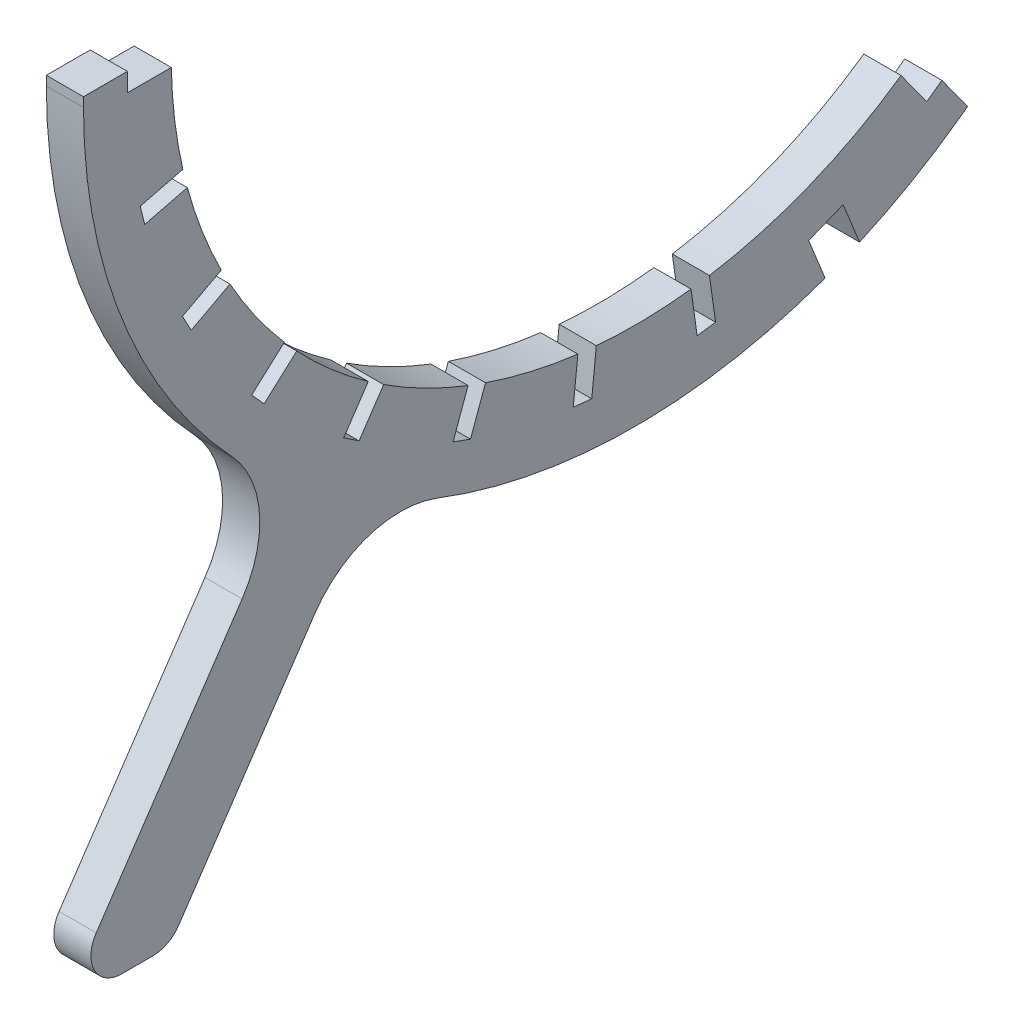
from build123d import *

# Parameters (mm, degrees)
EXTRUDE_1_DEPTH = 18


with BuildPart() as part:
    # Sketch 1 → Extrude 1 (new, symmetric)
    with BuildSketch(Plane(origin=(0, 0, 0), x_dir=(0, 0, -1), z_dir=(1, 0, 0))):
        with BuildLine():
            Line((296.765389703, -393.150802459), (321.746262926, -427.53402472))
            Line((321.746262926, -427.53402472), (314.465109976, -432.824091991))
            ThreePointArc((314.465109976, -432.824091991), (267.209125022, -463.491406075), (216.990372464, -489.019609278))
            Line((216.990372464, -489.019609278), (201.069592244, -449.614295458))
            Line((201.069592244, -449.614295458), (167.690973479, -463.100132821))
            Line((167.690973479, -463.100132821), (183.6117537, -502.50544664))
            ThreePointArc((183.6117537, -502.50544664), (-4.481571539, -534.981229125), (-192.00443448, -499.358886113))
            ThreePointArc((-192.00443448, -499.358886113), (-257.937188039, -497.316947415), (-310.796871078, -536.77770532))
            Line((-310.796871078, -536.77770532), (-442.74335886, -732.396418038))
            ThreePointArc((-442.74335886, -732.396418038), (-453.530339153, -742.109058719), (-467.614486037, -745.620630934))
            Line((-467.614486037, -745.620630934), (-497.769934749, -745.620630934))
            ThreePointArc((-497.769934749, -745.620630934), (-524.258362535, -729.704777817), (-522.641061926, -698.84484383))
            Line((-522.641061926, -698.84484383), (-381.265064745, -489.246308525))
            ThreePointArc((-381.265064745, -489.246308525), (-364.479272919, -425.453403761), (-391.071369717, -365.086542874))
            ThreePointArc((-391.071369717, -365.086542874), (-497.718887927, -196.216484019), (-535, 0))
            Line((-535, 0), (-535, 9))
            Line((-535, 9), (-492.5, 9))
            Line((-492.5, 9), (-492.5, -9))
            Line((-492.5, -9), (-449.909990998, -9))
            ThreePointArc((-449.909990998, -9), (-446.645768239, -54.841204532), (-438.723038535, -100.110416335))
            Line((-438.723038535, -100.110416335), (-480.047942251, -110.413872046))
            Line((-480.047942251, -110.413872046), (-475.693348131, -127.879195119))
            Line((-475.693348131, -127.879195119), (-434.368444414, -117.575739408))
            ThreePointArc((-434.368444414, -117.575739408), (-420.111191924, -161.265577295), (-401.47218762, -203.273418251))
            Line((-401.47218762, -203.273418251), (-439.076933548, -223.268216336))
            Line((-439.076933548, -223.268216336), (-430.626445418, -239.161273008))
            Line((-430.626445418, -239.161273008), (-393.02169949, -219.166474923))
            ThreePointArc((-393.02169949, -219.166474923), (-368.61841993, -258.109396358), (-340.370457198, -294.360241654))
            Line((-340.370457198, -294.360241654), (-372.021002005, -322.858520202))
            Line((-372.021002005, -322.858520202), (-359.97665109, -336.235127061))
            Line((-359.97665109, -336.235127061), (-328.326106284, -307.736848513))
            ThreePointArc((-328.326106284, -307.736848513), (-295.226563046, -339.6193111), (-259.04781232, -367.959550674))
            Line((-259.04781232, -367.959550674), (-282.863843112, -403.268268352))
            Line((-282.863843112, -403.268268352), (-267.941166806, -413.333740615))
            Line((-267.941166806, -413.333740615), (-244.125136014, -378.025022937))
            ThreePointArc((-244.125136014, -378.025022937), (-204.295724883, -400.952935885), (-162.335513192, -419.698917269))
            Line((-162.335513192, -419.698917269), (-176.902154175, -459.720434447))
            Line((-176.902154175, -459.720434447), (-159.987687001, -465.876797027))
            Line((-159.987687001, -465.876797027), (-145.421046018, -425.855279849))
            ThreePointArc((-145.421046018, -425.855279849), (-101.227974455, -438.466529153), (-55.979097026, -446.504580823))
            Line((-55.979097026, -446.504580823), (-60.430965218, -488.861277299))
            Line((-60.430965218, -488.861277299), (-42.529571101, -490.742789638))
            Line((-42.529571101, -490.742789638), (-38.077702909, -448.386093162))
            ThreePointArc((-38.077702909, -448.386093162), (7.853582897, -449.93146282), (53.702955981, -446.784055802))
            Line((53.702955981, -446.784055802), (59.630339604, -488.959581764))
            Line((59.630339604, -488.959581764), (77.455164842, -486.454465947))
            Line((77.455164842, -486.454465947), (71.527781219, -444.278939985))
            ThreePointArc((71.527781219, -444.278939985), (168.572967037, -417.232734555), (257.169304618, -369.274895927))
            Line((257.169304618, -369.274895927), (282.203083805, -403.730937))
            Line((282.203083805, -403.730937), (296.765389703, -393.150802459))
        make_face()
    extrude(amount=EXTRUDE_1_DEPTH, both=True)


solid = part.part
